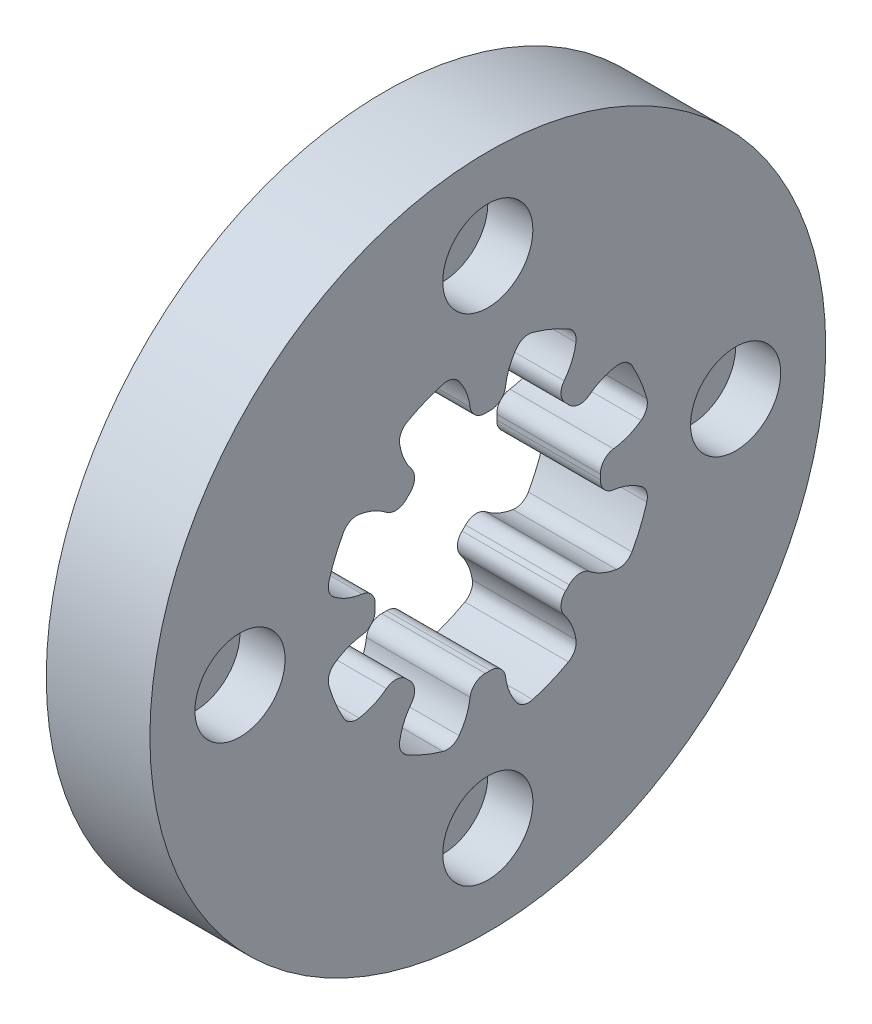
from build123d import *

# Parameters (mm, degrees)
BASPROSKE_W         = 7
BASPROSKE_H         = 11
TOOTHCUT_DEPTH      = 18.058722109
TEETHCUTS_COUNT     = 8
BORSKE_R            = 1.5
BORE_DEPTH          = 50.0000508
SKETCH2_R           = 22.5
BOSS_EXTRUDE2_DEPTH = 6.9
CUT_EXTRUDE1_DEPTH  = 33.580669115
FILLET1_R           = 1
SKETCH4_R           = 3
CUT_EXTRUDE2_DEPTH  = 3
SKETCH5_R           = 1
CUT_EXTRUDE3_DEPTH  = 33.057916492
CIRPATTERN1_COUNT   = 4


with BuildPart() as part:
    # BasProSke → Base-Revolve (revolve)
    with BuildSketch(Plane(origin=(0, 0, 0), x_dir=(1, 0, 0), z_dir=(0, 1, 0)), mode=Mode.PRIVATE) as base_revolve_sk:
        with Locations((3.5, 5.5)):
            Rectangle(BASPROSKE_W, BASPROSKE_H)
    revolve(base_revolve_sk.sketch.rotate(Axis((-10, 0, 0), (1, 0, 0)), 180), axis=Axis((-10, 0, 0), (1, 0, 0)))

    # TooCutSke → ToothCut (cut, through all)
    with BuildSketch(Plane(origin=(0, 0, 0), x_dir=(0, 0, -1), z_dir=(1, 0, 0))):
        with BuildLine():
            ThreePointArc((1.173662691, 7.406586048), (0, 7.499), (-1.173662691, 7.406586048))
            ThreePointArc((-1.173662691, 7.406586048), (-1.668191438, 9.834565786), (-3.497907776, 11.50542856))
            ThreePointArc((-3.497907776, 11.50542856), (0, 12.0254), (3.497907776, 11.50542856))
            ThreePointArc((3.497907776, 11.50542856), (1.668191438, 9.834565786), (1.173662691, 7.406586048))
        make_face()
    toothcut = extrude(amount=TOOTHCUT_DEPTH, mode=Mode.SUBTRACT)

    # TeethCuts: ToothCut ×8 about axis
    teethcuts_axis = Axis((0, 0, 0), (1, 0, 0))
    for i in range(1, TEETHCUTS_COUNT):
        add(toothcut.rotate(teethcuts_axis, i * 360 / TEETHCUTS_COUNT), mode=Mode.SUBTRACT)

    # BorSke → Bore (cut, symmetric)
    with BuildSketch(Plane(origin=(0, 0, 0), x_dir=(0, 0, -1), z_dir=(1, 0, 0))):
        with Locations(Location((0, 0, 0), (0, 0, 180))):
            Circle(BORSKE_R)
    extrude(amount=BORE_DEPTH, both=True, mode=Mode.SUBTRACT)

    # Sketch2 → Boss-Extrude2 (add)
    with BuildSketch(Plane(origin=(7, 0, 0), x_dir=(0, 0, -1), z_dir=(1, 0, 0))):
        Circle(SKETCH2_R)
    extrude(amount=-BOSS_EXTRUDE2_DEPTH)

    # Sketch3 → Cut-Extrude1 (cut, through all)
    with BuildSketch(Plane.ZY):
        with BuildLine():
            ThreePointArc((7.406586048, 1.173662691), (9.213824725, 1.38323845), (10.74130009, 2.371597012))
            ThreePointArc((10.74130009, 2.371597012), (10.162674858, 4.209517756), (9.272218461, 5.918273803))
            ThreePointArc((9.272218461, 5.918273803), (7.493255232, 5.537060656), (6.067152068, 4.407342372))
            ThreePointArc((6.067152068, 4.407342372), (5.302593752, 5.302593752), (4.407342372, 6.067152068))
            ThreePointArc((4.407342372, 6.067152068), (5.537060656, 7.493255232), (5.918273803, 9.272218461))
            ThreePointArc((5.918273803, 9.272218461), (4.209517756, 10.162674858), (2.371597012, 10.74130009))
            ThreePointArc((2.371597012, 10.74130009), (1.38323845, 9.213824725), (1.173662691, 7.406586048))
            ThreePointArc((1.173662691, 7.406586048), (0, 7.499), (-1.173662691, 7.406586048))
            ThreePointArc((-1.173662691, 7.406586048), (-1.38323845, 9.213824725), (-2.371597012, 10.74130009))
            ThreePointArc((-2.371597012, 10.74130009), (-4.209517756, 10.162674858), (-5.918273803, 9.272218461))
            ThreePointArc((-5.918273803, 9.272218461), (-5.537060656, 7.493255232), (-4.407342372, 6.067152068))
            ThreePointArc((-4.407342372, 6.067152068), (-5.302593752, 5.302593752), (-6.067152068, 4.407342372))
            ThreePointArc((-6.067152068, 4.407342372), (-7.493255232, 5.537060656), (-9.272218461, 5.918273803))
            ThreePointArc((-9.272218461, 5.918273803), (-10.162674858, 4.209517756), (-10.74130009, 2.371597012))
            ThreePointArc((-10.74130009, 2.371597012), (-9.213824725, 1.38323845), (-7.406586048, 1.173662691))
            ThreePointArc((-7.406586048, 1.173662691), (-7.499, 0), (-7.406586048, -1.173662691))
            ThreePointArc((-7.406586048, -1.173662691), (-9.213824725, -1.38323845), (-10.74130009, -2.371597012))
            ThreePointArc((-10.74130009, -2.371597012), (-10.162674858, -4.209517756), (-9.272218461, -5.918273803))
            ThreePointArc((-9.272218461, -5.918273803), (-7.493255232, -5.537060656), (-6.067152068, -4.407342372))
            ThreePointArc((-6.067152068, -4.407342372), (-5.302593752, -5.302593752), (-4.407342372, -6.067152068))
            ThreePointArc((-4.407342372, -6.067152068), (-5.537060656, -7.493255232), (-5.918273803, -9.272218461))
            ThreePointArc((-5.918273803, -9.272218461), (-4.209517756, -10.162674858), (-2.371597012, -10.74130009))
            ThreePointArc((-2.371597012, -10.74130009), (-1.38323845, -9.213824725), (-1.173662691, -7.406586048))
            ThreePointArc((-1.173662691, -7.406586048), (0, -7.499), (1.173662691, -7.406586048))
            ThreePointArc((1.173662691, -7.406586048), (1.38323845, -9.213824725), (2.371597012, -10.74130009))
            ThreePointArc((2.371597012, -10.74130009), (4.209517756, -10.162674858), (5.918273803, -9.272218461))
            ThreePointArc((5.918273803, -9.272218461), (5.537060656, -7.493255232), (4.407342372, -6.067152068))
            ThreePointArc((4.407342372, -6.067152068), (5.302593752, -5.302593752), (6.067152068, -4.407342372))
            ThreePointArc((6.067152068, -4.407342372), (7.493255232, -5.537060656), (9.272218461, -5.918273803))
            ThreePointArc((9.272218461, -5.918273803), (10.162674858, -4.209517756), (10.74130009, -2.371597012))
            ThreePointArc((10.74130009, -2.371597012), (9.213824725, -1.38323845), (7.406586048, -1.173662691))
            ThreePointArc((7.406586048, -1.173662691), (7.499, 0), (7.406586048, 1.173662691))
        make_face()
    extrude(amount=-CUT_EXTRUDE1_DEPTH, mode=Mode.SUBTRACT)

    # Fillet1
    fillet1_edges = [part.edges().sort_by_distance(p)[0] for p in [
        (3.55, 1.173662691, 7.406586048),
        (3.55, -1.173662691, 7.406586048),
        (3.55, -2.371597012, 10.74130009),
        (3.55, -5.918273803, 9.272218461),
        (3.55, -4.407342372, 6.067152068),
        (3.55, -6.067152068, 4.407342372),
        (3.55, -9.272218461, 5.918273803),
        (3.55, -10.74130009, 2.371597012),
        (3.55, -7.406586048, 1.173662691),
        (3.55, -7.406586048, -1.173662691),
        (3.55, -10.74130009, -2.371597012),
        (3.55, -9.272218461, -5.918273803),
        (3.55, -6.067152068, -4.407342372),
        (3.55, -4.407342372, -6.067152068),
        (3.55, -5.918273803, -9.272218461),
        (3.55, -2.371597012, -10.74130009),
        (3.55, -1.173662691, -7.406586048),
        (3.55, 1.173662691, -7.406586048),
        (3.55, 2.371597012, -10.74130009),
        (3.55, 5.918273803, -9.272218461),
        (3.55, 4.407342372, -6.067152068),
        (3.55, 6.067152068, -4.407342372),
        (3.55, 9.272218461, -5.918273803),
        (3.55, 10.74130009, -2.371597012),
        (3.55, 7.406586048, -1.173662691),
        (3.55, 7.406586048, 1.173662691),
        (3.55, 10.74130009, 2.371597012),
        (3.55, 9.272218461, 5.918273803),
        (3.55, 6.067152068, 4.407342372),
        (3.55, 4.407342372, 6.067152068),
        (3.55, 5.918273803, 9.272218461),
        (3.55, 2.371597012, 10.74130009),
    ]]
    fillet(fillet1_edges, radius=FILLET1_R)

    # Sketch4 → Cut-Extrude2 (cut)
    with BuildSketch(Plane(origin=(7, 0, 0), x_dir=(0, 0, -1), z_dir=(1, 0, 0))):
        with Locations((0, 16.5)):
            Circle(SKETCH4_R)
    cut_extrude2 = extrude(amount=-CUT_EXTRUDE2_DEPTH, mode=Mode.SUBTRACT)

    # Sketch5 → Cut-Extrude3 (cut, through all)
    with BuildSketch(Plane(origin=(4, 0, 0), x_dir=(0, 0, -1), z_dir=(1, 0, 0))):
        with Locations((0, 16.5)):
            Circle(SKETCH5_R)
    cut_extrude3 = extrude(amount=-CUT_EXTRUDE3_DEPTH, mode=Mode.SUBTRACT)

    # CirPattern1: Cut-Extrude2, Cut-Extrude3 ×4 about axis
    cirpattern1_axis = Axis((0, 0, 0), (1, 0, 0))
    add([cut_extrude2.rotate(cirpattern1_axis, i * 360 / CIRPATTERN1_COUNT) for i in range(1, CIRPATTERN1_COUNT)], mode=Mode.SUBTRACT)
    add([cut_extrude3.rotate(cirpattern1_axis, i * 360 / CIRPATTERN1_COUNT) for i in range(1, CIRPATTERN1_COUNT)], mode=Mode.SUBTRACT)


solid = part.part
